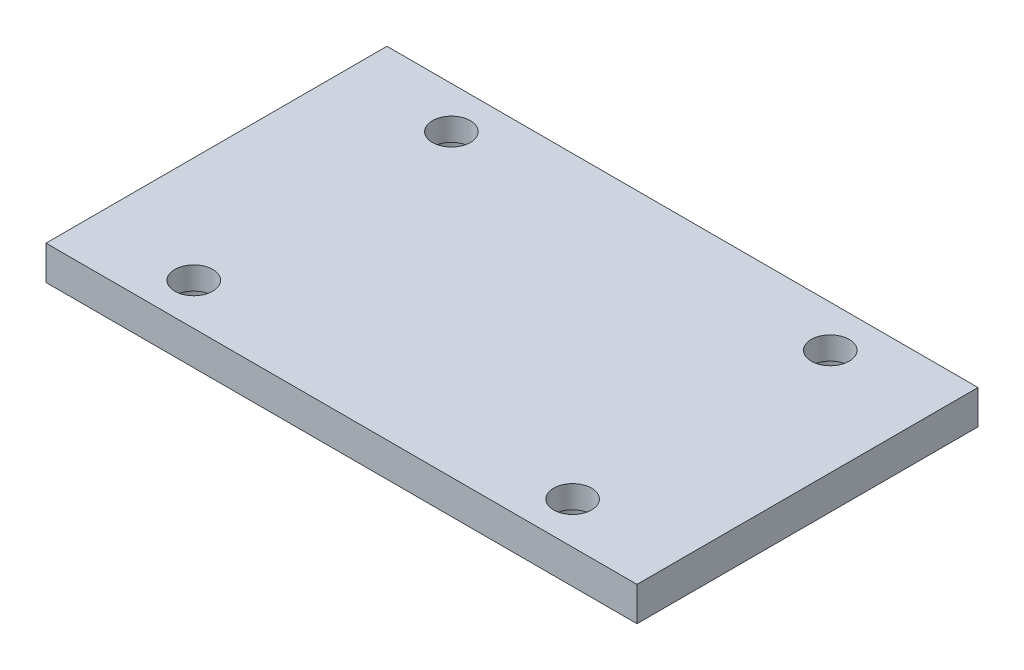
ISO-10303-21;
HEADER;
FILE_DESCRIPTION(('STEP AP214'),'2;1');
FILE_NAME('part.step','',(''),(''),'','','');
FILE_SCHEMA(('AUTOMOTIVE_DESIGN { 1 0 10303 214 1 1 1 1 }'));
ENDSEC;
DATA;
#1=APPLICATION_CONTEXT('core data for automotive mechanical design processes');
#2=APPLICATION_PROTOCOL_DEFINITION('international standard','automotive_design',2000,#1);
#3=PRODUCT_CONTEXT('',#1,'mechanical');
#4=PRODUCT('Part','Part','',(#3));
#5=PRODUCT_RELATED_PRODUCT_CATEGORY('part','',(#4));
#6=PRODUCT_DEFINITION_FORMATION('','',#4);
#7=PRODUCT_DEFINITION_CONTEXT('part definition',#1,'design');
#8=PRODUCT_DEFINITION('design','',#6,#7);
#9=PRODUCT_DEFINITION_SHAPE('','',#8);
#10=(LENGTH_UNIT() NAMED_UNIT(*) SI_UNIT(.MILLI.,.METRE.));
#11=(NAMED_UNIT(*) PLANE_ANGLE_UNIT() SI_UNIT($,.RADIAN.));
#12=(NAMED_UNIT(*) SI_UNIT($,.STERADIAN.) SOLID_ANGLE_UNIT());
#13=UNCERTAINTY_MEASURE_WITH_UNIT(LENGTH_MEASURE(1.E-05),#10,'distance_accuracy_value','');
#14=(GEOMETRIC_REPRESENTATION_CONTEXT(3) GLOBAL_UNCERTAINTY_ASSIGNED_CONTEXT((#13)) GLOBAL_UNIT_ASSIGNED_CONTEXT((#10,
#11,#12)) REPRESENTATION_CONTEXT('',''));
#15=CARTESIAN_POINT('',(0.,0.,0.));
#16=DIRECTION('',(0.,0.,1.));
#17=DIRECTION('',(1.,0.,0.));
#18=AXIS2_PLACEMENT_3D('',#15,#16,#17);
#19=CARTESIAN_POINT('',(-49.9999999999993,9.,-34.0000000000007));
#20=DIRECTION('',(0.,-1.,0.));
#21=DIRECTION('',(0.,0.,-1.));
#22=AXIS2_PLACEMENT_3D('',#19,#20,#21);
#23=CYLINDRICAL_SURFACE('',#22,5.00000000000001);
#24=CARTESIAN_POINT('',(-49.9999999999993,9.,-34.0000000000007));
#25=DIRECTION('',(0.,-1.,0.));
#26=DIRECTION('',(0.,0.,-1.));
#27=AXIS2_PLACEMENT_3D('',#24,#25,#26);
#28=CIRCLE('',#27,5.00000000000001);
#29=CARTESIAN_POINT('',(-49.9999999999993,9.,-39.0000000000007));
#30=VERTEX_POINT('',#29);
#31=EDGE_CURVE('E110',#30,#30,#28,.T.);
#32=ORIENTED_EDGE('',*,*,#31,.F.);
#33=EDGE_LOOP('',(#32));
#34=FACE_BOUND('',#33,.T.);
#35=CARTESIAN_POINT('',(-49.9999999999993,3.,-34.0000000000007));
#36=DIRECTION('',(0.,-1.,0.));
#37=DIRECTION('',(0.,0.,-1.));
#38=AXIS2_PLACEMENT_3D('',#35,#36,#37);
#39=CIRCLE('',#38,5.00000000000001);
#40=CARTESIAN_POINT('',(-49.9999999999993,3.,-39.0000000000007));
#41=VERTEX_POINT('',#40);
#42=EDGE_CURVE('E35',#41,#41,#39,.F.);
#43=ORIENTED_EDGE('',*,*,#42,.F.);
#44=EDGE_LOOP('',(#43));
#45=FACE_BOUND('',#44,.T.);
#46=ADVANCED_FACE('F31',(#34,#45),#23,.F.);
#47=CARTESIAN_POINT('',(50.0000000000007,9.,-34.));
#48=DIRECTION('',(0.,-1.,0.));
#49=DIRECTION('',(0.,0.,-1.));
#50=AXIS2_PLACEMENT_3D('',#47,#48,#49);
#51=CYLINDRICAL_SURFACE('',#50,5.00000000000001);
#52=CARTESIAN_POINT('',(50.0000000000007,9.,-34.));
#53=DIRECTION('',(0.,-1.,0.));
#54=DIRECTION('',(0.,0.,-1.));
#55=AXIS2_PLACEMENT_3D('',#52,#53,#54);
#56=CIRCLE('',#55,5.00000000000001);
#57=CARTESIAN_POINT('',(50.0000000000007,9.,-39.));
#58=VERTEX_POINT('',#57);
#59=EDGE_CURVE('E143',#58,#58,#56,.T.);
#60=ORIENTED_EDGE('',*,*,#59,.F.);
#61=EDGE_LOOP('',(#60));
#62=FACE_BOUND('',#61,.T.);
#63=CARTESIAN_POINT('',(50.0000000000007,3.,-34.));
#64=DIRECTION('',(0.,-1.,0.));
#65=DIRECTION('',(0.,0.,-1.));
#66=AXIS2_PLACEMENT_3D('',#63,#64,#65);
#67=CIRCLE('',#66,5.00000000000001);
#68=CARTESIAN_POINT('',(50.0000000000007,3.,-39.));
#69=VERTEX_POINT('',#68);
#70=EDGE_CURVE('E116',#69,#69,#67,.F.);
#71=ORIENTED_EDGE('',*,*,#70,.F.);
#72=EDGE_LOOP('',(#71));
#73=FACE_BOUND('',#72,.T.);
#74=ADVANCED_FACE('F177',(#62,#73),#51,.F.);
#75=CARTESIAN_POINT('',(-50.,9.,33.9999999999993));
#76=DIRECTION('',(0.,-1.,0.));
#77=DIRECTION('',(0.,0.,-1.));
#78=AXIS2_PLACEMENT_3D('',#75,#76,#77);
#79=CYLINDRICAL_SURFACE('',#78,5.00000000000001);
#80=CARTESIAN_POINT('',(-50.,9.,33.9999999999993));
#81=DIRECTION('',(0.,-1.,0.));
#82=DIRECTION('',(0.,0.,-1.));
#83=AXIS2_PLACEMENT_3D('',#80,#81,#82);
#84=CIRCLE('',#83,5.00000000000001);
#85=CARTESIAN_POINT('',(-50.,9.,28.9999999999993));
#86=VERTEX_POINT('',#85);
#87=EDGE_CURVE('E146',#86,#86,#84,.T.);
#88=ORIENTED_EDGE('',*,*,#87,.F.);
#89=EDGE_LOOP('',(#88));
#90=FACE_BOUND('',#89,.T.);
#91=CARTESIAN_POINT('',(-50.,3.,33.9999999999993));
#92=DIRECTION('',(0.,-1.,0.));
#93=DIRECTION('',(0.,0.,-1.));
#94=AXIS2_PLACEMENT_3D('',#91,#92,#93);
#95=CIRCLE('',#94,5.00000000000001);
#96=CARTESIAN_POINT('',(-50.,3.,28.9999999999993));
#97=VERTEX_POINT('',#96);
#98=EDGE_CURVE('E112',#97,#97,#95,.F.);
#99=ORIENTED_EDGE('',*,*,#98,.F.);
#100=EDGE_LOOP('',(#99));
#101=FACE_BOUND('',#100,.T.);
#102=ADVANCED_FACE('F156',(#90,#101),#79,.F.);
#103=CARTESIAN_POINT('',(50.,9.,34.));
#104=DIRECTION('',(0.,-1.,0.));
#105=DIRECTION('',(0.,0.,-1.));
#106=AXIS2_PLACEMENT_3D('',#103,#104,#105);
#107=CYLINDRICAL_SURFACE('',#106,5.00000000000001);
#108=CARTESIAN_POINT('',(50.,9.,34.));
#109=DIRECTION('',(0.,-1.,0.));
#110=DIRECTION('',(0.,0.,-1.));
#111=AXIS2_PLACEMENT_3D('',#108,#109,#110);
#112=CIRCLE('',#111,5.00000000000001);
#113=CARTESIAN_POINT('',(50.,9.,29.));
#114=VERTEX_POINT('',#113);
#115=EDGE_CURVE('E101',#114,#114,#112,.T.);
#116=ORIENTED_EDGE('',*,*,#115,.F.);
#117=EDGE_LOOP('',(#116));
#118=FACE_BOUND('',#117,.T.);
#119=CARTESIAN_POINT('',(50.,3.,34.));
#120=DIRECTION('',(0.,-1.,0.));
#121=DIRECTION('',(0.,0.,-1.));
#122=AXIS2_PLACEMENT_3D('',#119,#120,#121);
#123=CIRCLE('',#122,5.00000000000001);
#124=CARTESIAN_POINT('',(50.,3.,29.));
#125=VERTEX_POINT('',#124);
#126=EDGE_CURVE('E107',#125,#125,#123,.F.);
#127=ORIENTED_EDGE('',*,*,#126,.F.);
#128=EDGE_LOOP('',(#127));
#129=FACE_BOUND('',#128,.T.);
#130=ADVANCED_FACE('F153',(#118,#129),#107,.F.);
#131=CARTESIAN_POINT('',(78.,9.,45.));
#132=DIRECTION('',(-1.,0.,0.));
#133=DIRECTION('',(0.,0.,1.));
#134=AXIS2_PLACEMENT_3D('',#131,#132,#133);
#135=PLANE('',#134);
#136=DIRECTION('',(0.,0.,-1.));
#137=VECTOR('',#136,1.);
#138=CARTESIAN_POINT('',(78.,0.,45.));
#139=LINE('',#138,#137);
#140=CARTESIAN_POINT('',(78.,0.,45.));
#141=VERTEX_POINT('',#140);
#142=CARTESIAN_POINT('',(78.,0.,-45.));
#143=VERTEX_POINT('',#142);
#144=EDGE_CURVE('E98',#141,#143,#139,.T.);
#145=ORIENTED_EDGE('',*,*,#144,.T.);
#146=DIRECTION('',(0.,-1.,0.));
#147=VECTOR('',#146,1.);
#148=CARTESIAN_POINT('',(78.,9.,-45.));
#149=LINE('',#148,#147);
#150=CARTESIAN_POINT('',(78.,9.,-45.));
#151=VERTEX_POINT('',#150);
#152=EDGE_CURVE('E11',#151,#143,#149,.T.);
#153=ORIENTED_EDGE('',*,*,#152,.F.);
#154=DIRECTION('',(0.,0.,-1.));
#155=VECTOR('',#154,1.);
#156=CARTESIAN_POINT('',(78.,9.,45.));
#157=LINE('',#156,#155);
#158=CARTESIAN_POINT('',(78.,9.,45.));
#159=VERTEX_POINT('',#158);
#160=EDGE_CURVE('E85',#159,#151,#157,.T.);
#161=ORIENTED_EDGE('',*,*,#160,.F.);
#162=DIRECTION('',(0.,-1.,0.));
#163=VECTOR('',#162,1.);
#164=CARTESIAN_POINT('',(78.,9.,45.));
#165=LINE('',#164,#163);
#166=EDGE_CURVE('E94',#159,#141,#165,.T.);
#167=ORIENTED_EDGE('',*,*,#166,.T.);
#168=EDGE_LOOP('',(#145,#153,#161,#167));
#169=FACE_BOUND('',#168,.T.);
#170=ADVANCED_FACE('F33',(#169),#135,.F.);
#171=CARTESIAN_POINT('',(-78.,9.,-45.));
#172=DIRECTION('',(0.,0.,1.));
#173=DIRECTION('',(1.,0.,0.));
#174=AXIS2_PLACEMENT_3D('',#171,#172,#173);
#175=PLANE('',#174);
#176=DIRECTION('',(-1.,0.,0.));
#177=VECTOR('',#176,1.);
#178=CARTESIAN_POINT('',(-78.,0.,-45.));
#179=LINE('',#178,#177);
#180=CARTESIAN_POINT('',(-78.,0.,-45.));
#181=VERTEX_POINT('',#180);
#182=EDGE_CURVE('E89',#143,#181,#179,.T.);
#183=ORIENTED_EDGE('',*,*,#182,.T.);
#184=DIRECTION('',(0.,-1.,0.));
#185=VECTOR('',#184,1.);
#186=CARTESIAN_POINT('',(-78.,9.,-45.));
#187=LINE('',#186,#185);
#188=CARTESIAN_POINT('',(-78.,9.,-45.));
#189=VERTEX_POINT('',#188);
#190=EDGE_CURVE('E41',#189,#181,#187,.T.);
#191=ORIENTED_EDGE('',*,*,#190,.F.);
#192=DIRECTION('',(-1.,0.,0.));
#193=VECTOR('',#192,1.);
#194=CARTESIAN_POINT('',(-78.,9.,-45.));
#195=LINE('',#194,#193);
#196=EDGE_CURVE('E80',#151,#189,#195,.T.);
#197=ORIENTED_EDGE('',*,*,#196,.F.);
#198=ORIENTED_EDGE('',*,*,#152,.T.);
#199=EDGE_LOOP('',(#183,#191,#197,#198));
#200=FACE_BOUND('',#199,.T.);
#201=ADVANCED_FACE('F88',(#200),#175,.F.);
#202=CARTESIAN_POINT('',(-78.,9.,45.));
#203=DIRECTION('',(1.,0.,0.));
#204=DIRECTION('',(0.,0.,-1.));
#205=AXIS2_PLACEMENT_3D('',#202,#203,#204);
#206=PLANE('',#205);
#207=DIRECTION('',(0.,0.,1.));
#208=VECTOR('',#207,1.);
#209=CARTESIAN_POINT('',(-78.,0.,45.));
#210=LINE('',#209,#208);
#211=CARTESIAN_POINT('',(-78.,0.,45.));
#212=VERTEX_POINT('',#211);
#213=EDGE_CURVE('E67',#181,#212,#210,.T.);
#214=ORIENTED_EDGE('',*,*,#213,.T.);
#215=DIRECTION('',(0.,-1.,0.));
#216=VECTOR('',#215,1.);
#217=CARTESIAN_POINT('',(-78.,9.,45.));
#218=LINE('',#217,#216);
#219=CARTESIAN_POINT('',(-78.,9.,45.));
#220=VERTEX_POINT('',#219);
#221=EDGE_CURVE('E90',#220,#212,#218,.T.);
#222=ORIENTED_EDGE('',*,*,#221,.F.);
#223=DIRECTION('',(0.,0.,1.));
#224=VECTOR('',#223,1.);
#225=CARTESIAN_POINT('',(-78.,9.,45.));
#226=LINE('',#225,#224);
#227=EDGE_CURVE('E83',#189,#220,#226,.T.);
#228=ORIENTED_EDGE('',*,*,#227,.F.);
#229=ORIENTED_EDGE('',*,*,#190,.T.);
#230=EDGE_LOOP('',(#214,#222,#228,#229));
#231=FACE_BOUND('',#230,.T.);
#232=ADVANCED_FACE('F92',(#231),#206,.F.);
#233=CARTESIAN_POINT('',(-78.,9.,45.));
#234=DIRECTION('',(0.,0.,-1.));
#235=DIRECTION('',(-1.,0.,0.));
#236=AXIS2_PLACEMENT_3D('',#233,#234,#235);
#237=PLANE('',#236);
#238=DIRECTION('',(1.,0.,0.));
#239=VECTOR('',#238,1.);
#240=CARTESIAN_POINT('',(-78.,0.,45.));
#241=LINE('',#240,#239);
#242=EDGE_CURVE('E73',#212,#141,#241,.T.);
#243=ORIENTED_EDGE('',*,*,#242,.T.);
#244=ORIENTED_EDGE('',*,*,#166,.F.);
#245=DIRECTION('',(1.,0.,0.));
#246=VECTOR('',#245,1.);
#247=CARTESIAN_POINT('',(-78.,9.,45.));
#248=LINE('',#247,#246);
#249=EDGE_CURVE('E50',#220,#159,#248,.T.);
#250=ORIENTED_EDGE('',*,*,#249,.F.);
#251=ORIENTED_EDGE('',*,*,#221,.T.);
#252=EDGE_LOOP('',(#243,#244,#250,#251));
#253=FACE_BOUND('',#252,.T.);
#254=ADVANCED_FACE('F193',(#253),#237,.F.);
#255=CARTESIAN_POINT('',(78.,9.,-45.));
#256=DIRECTION('',(0.,-1.,0.));
#257=DIRECTION('',(0.,0.,-1.));
#258=AXIS2_PLACEMENT_3D('',#255,#256,#257);
#259=PLANE('',#258);
#260=ORIENTED_EDGE('',*,*,#31,.T.);
#261=EDGE_LOOP('',(#260));
#262=FACE_BOUND('',#261,.T.);
#263=ORIENTED_EDGE('',*,*,#59,.T.);
#264=EDGE_LOOP('',(#263));
#265=FACE_BOUND('',#264,.T.);
#266=ORIENTED_EDGE('',*,*,#87,.T.);
#267=EDGE_LOOP('',(#266));
#268=FACE_BOUND('',#267,.T.);
#269=ORIENTED_EDGE('',*,*,#115,.T.);
#270=EDGE_LOOP('',(#269));
#271=FACE_BOUND('',#270,.T.);
#272=ORIENTED_EDGE('',*,*,#160,.T.);
#273=ORIENTED_EDGE('',*,*,#196,.T.);
#274=ORIENTED_EDGE('',*,*,#227,.T.);
#275=ORIENTED_EDGE('',*,*,#249,.T.);
#276=EDGE_LOOP('',(#272,#273,#274,#275));
#277=FACE_BOUND('',#276,.T.);
#278=ADVANCED_FACE('F81',(#262,#265,#268,#271,#277),#259,.F.);
#279=CARTESIAN_POINT('',(78.,0.,-45.));
#280=DIRECTION('',(0.,-1.,0.));
#281=DIRECTION('',(0.,0.,-1.));
#282=AXIS2_PLACEMENT_3D('',#279,#280,#281);
#283=PLANE('',#282);
#284=CARTESIAN_POINT('',(-49.9999999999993,0.,-34.0000000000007));
#285=DIRECTION('',(0.,-1.,0.));
#286=DIRECTION('',(0.,0.,-1.));
#287=AXIS2_PLACEMENT_3D('',#284,#285,#286);
#288=CIRCLE('',#287,7.5);
#289=CARTESIAN_POINT('',(-49.9999999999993,0.,-41.5000000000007));
#290=VERTEX_POINT('',#289);
#291=EDGE_CURVE('E132',#290,#290,#288,.T.);
#292=ORIENTED_EDGE('',*,*,#291,.F.);
#293=EDGE_LOOP('',(#292));
#294=FACE_BOUND('',#293,.T.);
#295=CARTESIAN_POINT('',(50.0000000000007,0.,-34.));
#296=DIRECTION('',(0.,-1.,0.));
#297=DIRECTION('',(0.,0.,-1.));
#298=AXIS2_PLACEMENT_3D('',#295,#296,#297);
#299=CIRCLE('',#298,7.5);
#300=CARTESIAN_POINT('',(50.0000000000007,0.,-41.5));
#301=VERTEX_POINT('',#300);
#302=EDGE_CURVE('E125',#301,#301,#299,.T.);
#303=ORIENTED_EDGE('',*,*,#302,.F.);
#304=EDGE_LOOP('',(#303));
#305=FACE_BOUND('',#304,.T.);
#306=CARTESIAN_POINT('',(-50.,0.,33.9999999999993));
#307=DIRECTION('',(0.,-1.,0.));
#308=DIRECTION('',(0.,0.,-1.));
#309=AXIS2_PLACEMENT_3D('',#306,#307,#308);
#310=CIRCLE('',#309,7.5);
#311=CARTESIAN_POINT('',(-50.,0.,26.4999999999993));
#312=VERTEX_POINT('',#311);
#313=EDGE_CURVE('E118',#312,#312,#310,.T.);
#314=ORIENTED_EDGE('',*,*,#313,.F.);
#315=EDGE_LOOP('',(#314));
#316=FACE_BOUND('',#315,.T.);
#317=CARTESIAN_POINT('',(50.,0.,34.));
#318=DIRECTION('',(0.,-1.,0.));
#319=DIRECTION('',(0.,0.,-1.));
#320=AXIS2_PLACEMENT_3D('',#317,#318,#319);
#321=CIRCLE('',#320,7.5);
#322=CARTESIAN_POINT('',(50.,0.,26.5));
#323=VERTEX_POINT('',#322);
#324=EDGE_CURVE('E114',#323,#323,#321,.T.);
#325=ORIENTED_EDGE('',*,*,#324,.F.);
#326=EDGE_LOOP('',(#325));
#327=FACE_BOUND('',#326,.T.);
#328=ORIENTED_EDGE('',*,*,#144,.F.);
#329=ORIENTED_EDGE('',*,*,#242,.F.);
#330=ORIENTED_EDGE('',*,*,#213,.F.);
#331=ORIENTED_EDGE('',*,*,#182,.F.);
#332=EDGE_LOOP('',(#328,#329,#330,#331));
#333=FACE_BOUND('',#332,.T.);
#334=ADVANCED_FACE('F163',(#294,#305,#316,#327,#333),#283,.T.);
#335=CARTESIAN_POINT('',(50.,3.,34.));
#336=DIRECTION('',(0.,-1.,0.));
#337=DIRECTION('',(0.,0.,-1.));
#338=AXIS2_PLACEMENT_3D('',#335,#336,#337);
#339=PLANE('',#338);
#340=CARTESIAN_POINT('',(50.,3.,34.));
#341=DIRECTION('',(0.,-1.,0.));
#342=DIRECTION('',(0.,0.,-1.));
#343=AXIS2_PLACEMENT_3D('',#340,#341,#342);
#344=CIRCLE('',#343,7.5);
#345=CARTESIAN_POINT('',(50.,3.,26.5));
#346=VERTEX_POINT('',#345);
#347=EDGE_CURVE('E111',#346,#346,#344,.T.);
#348=ORIENTED_EDGE('',*,*,#347,.T.);
#349=EDGE_LOOP('',(#348));
#350=FACE_BOUND('',#349,.T.);
#351=ORIENTED_EDGE('',*,*,#126,.T.);
#352=EDGE_LOOP('',(#351));
#353=FACE_BOUND('',#352,.T.);
#354=ADVANCED_FACE('F160',(#350,#353),#339,.T.);
#355=CARTESIAN_POINT('',(50.,3.,34.));
#356=DIRECTION('',(0.,-1.,0.));
#357=DIRECTION('',(0.,0.,-1.));
#358=AXIS2_PLACEMENT_3D('',#355,#356,#357);
#359=CYLINDRICAL_SURFACE('',#358,7.5);
#360=ORIENTED_EDGE('',*,*,#347,.F.);
#361=EDGE_LOOP('',(#360));
#362=FACE_BOUND('',#361,.T.);
#363=ORIENTED_EDGE('',*,*,#324,.T.);
#364=EDGE_LOOP('',(#363));
#365=FACE_BOUND('',#364,.T.);
#366=ADVANCED_FACE('F162',(#362,#365),#359,.F.);
#367=CARTESIAN_POINT('',(-50.,3.,33.9999999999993));
#368=DIRECTION('',(0.,-1.,0.));
#369=DIRECTION('',(0.,0.,-1.));
#370=AXIS2_PLACEMENT_3D('',#367,#368,#369);
#371=PLANE('',#370);
#372=CARTESIAN_POINT('',(-50.,3.,33.9999999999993));
#373=DIRECTION('',(0.,-1.,0.));
#374=DIRECTION('',(0.,0.,-1.));
#375=AXIS2_PLACEMENT_3D('',#372,#373,#374);
#376=CIRCLE('',#375,7.5);
#377=CARTESIAN_POINT('',(-50.,3.,26.4999999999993));
#378=VERTEX_POINT('',#377);
#379=EDGE_CURVE('E115',#378,#378,#376,.T.);
#380=ORIENTED_EDGE('',*,*,#379,.T.);
#381=EDGE_LOOP('',(#380));
#382=FACE_BOUND('',#381,.T.);
#383=ORIENTED_EDGE('',*,*,#98,.T.);
#384=EDGE_LOOP('',(#383));
#385=FACE_BOUND('',#384,.T.);
#386=ADVANCED_FACE('F169',(#382,#385),#371,.T.);
#387=CARTESIAN_POINT('',(-50.,3.,33.9999999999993));
#388=DIRECTION('',(0.,-1.,0.));
#389=DIRECTION('',(0.,0.,-1.));
#390=AXIS2_PLACEMENT_3D('',#387,#388,#389);
#391=CYLINDRICAL_SURFACE('',#390,7.5);
#392=ORIENTED_EDGE('',*,*,#379,.F.);
#393=EDGE_LOOP('',(#392));
#394=FACE_BOUND('',#393,.T.);
#395=ORIENTED_EDGE('',*,*,#313,.T.);
#396=EDGE_LOOP('',(#395));
#397=FACE_BOUND('',#396,.T.);
#398=ADVANCED_FACE('F272',(#394,#397),#391,.F.);
#399=CARTESIAN_POINT('',(50.0000000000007,3.,-34.));
#400=DIRECTION('',(0.,-1.,0.));
#401=DIRECTION('',(0.,0.,-1.));
#402=AXIS2_PLACEMENT_3D('',#399,#400,#401);
#403=PLANE('',#402);
#404=CARTESIAN_POINT('',(50.0000000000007,3.,-34.));
#405=DIRECTION('',(0.,-1.,0.));
#406=DIRECTION('',(0.,0.,-1.));
#407=AXIS2_PLACEMENT_3D('',#404,#405,#406);
#408=CIRCLE('',#407,7.5);
#409=CARTESIAN_POINT('',(50.0000000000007,3.,-41.5));
#410=VERTEX_POINT('',#409);
#411=EDGE_CURVE('E119',#410,#410,#408,.T.);
#412=ORIENTED_EDGE('',*,*,#411,.T.);
#413=EDGE_LOOP('',(#412));
#414=FACE_BOUND('',#413,.T.);
#415=ORIENTED_EDGE('',*,*,#70,.T.);
#416=EDGE_LOOP('',(#415));
#417=FACE_BOUND('',#416,.T.);
#418=ADVANCED_FACE('F282',(#414,#417),#403,.T.);
#419=CARTESIAN_POINT('',(50.0000000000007,3.,-34.));
#420=DIRECTION('',(0.,-1.,0.));
#421=DIRECTION('',(0.,0.,-1.));
#422=AXIS2_PLACEMENT_3D('',#419,#420,#421);
#423=CYLINDRICAL_SURFACE('',#422,7.5);
#424=ORIENTED_EDGE('',*,*,#411,.F.);
#425=EDGE_LOOP('',(#424));
#426=FACE_BOUND('',#425,.T.);
#427=ORIENTED_EDGE('',*,*,#302,.T.);
#428=EDGE_LOOP('',(#427));
#429=FACE_BOUND('',#428,.T.);
#430=ADVANCED_FACE('F291',(#426,#429),#423,.F.);
#431=CARTESIAN_POINT('',(-49.9999999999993,3.,-34.0000000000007));
#432=DIRECTION('',(0.,-1.,0.));
#433=DIRECTION('',(0.,0.,-1.));
#434=AXIS2_PLACEMENT_3D('',#431,#432,#433);
#435=PLANE('',#434);
#436=CARTESIAN_POINT('',(-49.9999999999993,3.,-34.0000000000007));
#437=DIRECTION('',(0.,-1.,0.));
#438=DIRECTION('',(0.,0.,-1.));
#439=AXIS2_PLACEMENT_3D('',#436,#437,#438);
#440=CIRCLE('',#439,7.5);
#441=CARTESIAN_POINT('',(-49.9999999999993,3.,-41.5000000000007));
#442=VERTEX_POINT('',#441);
#443=EDGE_CURVE('E327',#442,#442,#440,.T.);
#444=ORIENTED_EDGE('',*,*,#443,.T.);
#445=EDGE_LOOP('',(#444));
#446=FACE_BOUND('',#445,.T.);
#447=ORIENTED_EDGE('',*,*,#42,.T.);
#448=EDGE_LOOP('',(#447));
#449=FACE_BOUND('',#448,.T.);
#450=ADVANCED_FACE('F300',(#446,#449),#435,.T.);
#451=CARTESIAN_POINT('',(-49.9999999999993,3.,-34.0000000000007));
#452=DIRECTION('',(0.,-1.,0.));
#453=DIRECTION('',(0.,0.,-1.));
#454=AXIS2_PLACEMENT_3D('',#451,#452,#453);
#455=CYLINDRICAL_SURFACE('',#454,7.5);
#456=ORIENTED_EDGE('',*,*,#443,.F.);
#457=EDGE_LOOP('',(#456));
#458=FACE_BOUND('',#457,.T.);
#459=ORIENTED_EDGE('',*,*,#291,.T.);
#460=EDGE_LOOP('',(#459));
#461=FACE_BOUND('',#460,.T.);
#462=ADVANCED_FACE('F310',(#458,#461),#455,.F.);
#463=CLOSED_SHELL('',(#46,#74,#102,#130,#170,#201,#232,#254,#278,#334,#354,#366,#386,#398,#418,
#430,#450,#462));
#464=MANIFOLD_SOLID_BREP('B2',#463);
#465=ADVANCED_BREP_SHAPE_REPRESENTATION('',(#18,#464),#14);
#466=SHAPE_DEFINITION_REPRESENTATION(#9,#465);
ENDSEC;
END-ISO-10303-21;
